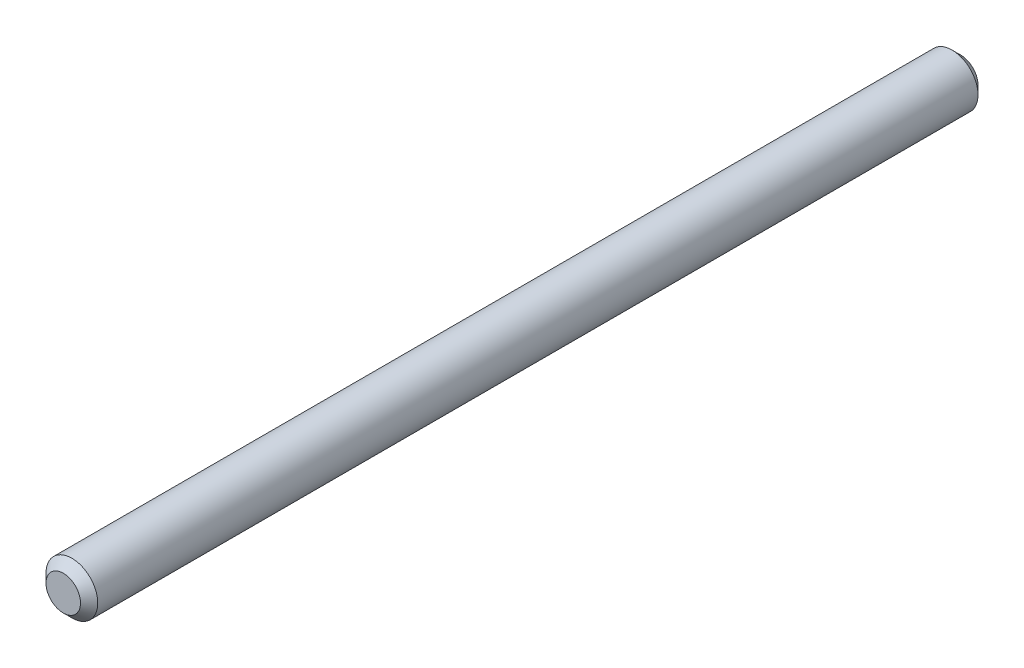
ISO-10303-21;
HEADER;
FILE_DESCRIPTION(('STEP AP214'),'2;1');
FILE_NAME('part.step','',(''),(''),'','','');
FILE_SCHEMA(('AUTOMOTIVE_DESIGN { 1 0 10303 214 1 1 1 1 }'));
ENDSEC;
DATA;
#1=APPLICATION_CONTEXT('core data for automotive mechanical design processes');
#2=APPLICATION_PROTOCOL_DEFINITION('international standard','automotive_design',2000,#1);
#3=PRODUCT_CONTEXT('',#1,'mechanical');
#4=PRODUCT('Part','Part','',(#3));
#5=PRODUCT_RELATED_PRODUCT_CATEGORY('part','',(#4));
#6=PRODUCT_DEFINITION_FORMATION('','',#4);
#7=PRODUCT_DEFINITION_CONTEXT('part definition',#1,'design');
#8=PRODUCT_DEFINITION('design','',#6,#7);
#9=PRODUCT_DEFINITION_SHAPE('','',#8);
#10=(LENGTH_UNIT() NAMED_UNIT(*) SI_UNIT(.MILLI.,.METRE.));
#11=(NAMED_UNIT(*) PLANE_ANGLE_UNIT() SI_UNIT($,.RADIAN.));
#12=(NAMED_UNIT(*) SI_UNIT($,.STERADIAN.) SOLID_ANGLE_UNIT());
#13=UNCERTAINTY_MEASURE_WITH_UNIT(LENGTH_MEASURE(1.E-05),#10,'distance_accuracy_value','');
#14=(GEOMETRIC_REPRESENTATION_CONTEXT(3) GLOBAL_UNCERTAINTY_ASSIGNED_CONTEXT((#13)) GLOBAL_UNIT_ASSIGNED_CONTEXT((#10,
#11,#12)) REPRESENTATION_CONTEXT('',''));
#15=CARTESIAN_POINT('',(0.,0.,0.));
#16=DIRECTION('',(0.,0.,1.));
#17=DIRECTION('',(1.,0.,0.));
#18=AXIS2_PLACEMENT_3D('',#15,#16,#17);
#19=CARTESIAN_POINT('',(0.,0.,52.));
#20=DIRECTION('',(0.,0.,-1.));
#21=DIRECTION('',(-1.,0.,0.));
#22=AXIS2_PLACEMENT_3D('',#19,#20,#21);
#23=CYLINDRICAL_SURFACE('',#22,1.5);
#24=CARTESIAN_POINT('',(0.,0.,51.5));
#25=DIRECTION('',(0.,0.,1.));
#26=DIRECTION('',(1.,0.,0.));
#27=AXIS2_PLACEMENT_3D('',#24,#25,#26);
#28=CIRCLE('',#27,1.5);
#29=CARTESIAN_POINT('',(-1.5,0.,51.5));
#30=VERTEX_POINT('',#29);
#31=EDGE_CURVE('E30',#30,#30,#28,.F.);
#32=CARTESIAN_POINT('',(0.,0.,0.500000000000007));
#33=DIRECTION('',(0.,0.,1.));
#34=DIRECTION('',(1.,0.,0.));
#35=AXIS2_PLACEMENT_3D('',#32,#33,#34);
#36=CIRCLE('',#35,1.5);
#37=CARTESIAN_POINT('',(-1.5,0.,0.5));
#38=VERTEX_POINT('',#37);
#39=EDGE_CURVE('E34',#38,#38,#36,.T.);
#40=CARTESIAN_POINT('',(-1.5,0.,51.5));
#41=CARTESIAN_POINT('',(-1.5,0.,50.96875));
#42=CARTESIAN_POINT('',(-1.5,0.,50.4375));
#43=CARTESIAN_POINT('',(-1.5,0.,49.375));
#44=CARTESIAN_POINT('',(-1.5,0.,48.84375));
#45=CARTESIAN_POINT('',(-1.5,0.,47.78125));
#46=CARTESIAN_POINT('',(-1.5,0.,47.25));
#47=CARTESIAN_POINT('',(-1.5,0.,46.1875));
#48=CARTESIAN_POINT('',(-1.5,0.,45.65625));
#49=CARTESIAN_POINT('',(-1.5,0.,44.59375));
#50=CARTESIAN_POINT('',(-1.5,0.,44.0625));
#51=CARTESIAN_POINT('',(-1.5,0.,43.));
#52=CARTESIAN_POINT('',(-1.5,0.,42.46875));
#53=CARTESIAN_POINT('',(-1.5,0.,41.40625));
#54=CARTESIAN_POINT('',(-1.5,0.,40.875));
#55=CARTESIAN_POINT('',(-1.5,0.,39.8125));
#56=CARTESIAN_POINT('',(-1.5,0.,39.28125));
#57=CARTESIAN_POINT('',(-1.5,0.,38.21875));
#58=CARTESIAN_POINT('',(-1.5,0.,37.6875));
#59=CARTESIAN_POINT('',(-1.5,0.,36.625));
#60=CARTESIAN_POINT('',(-1.5,0.,36.09375));
#61=CARTESIAN_POINT('',(-1.5,0.,35.03125));
#62=CARTESIAN_POINT('',(-1.5,0.,34.5));
#63=CARTESIAN_POINT('',(-1.5,0.,33.4375));
#64=CARTESIAN_POINT('',(-1.5,0.,32.90625));
#65=CARTESIAN_POINT('',(-1.5,0.,31.84375));
#66=CARTESIAN_POINT('',(-1.5,0.,31.3125));
#67=CARTESIAN_POINT('',(-1.5,0.,30.25));
#68=CARTESIAN_POINT('',(-1.5,0.,29.71875));
#69=CARTESIAN_POINT('',(-1.5,0.,28.65625));
#70=CARTESIAN_POINT('',(-1.5,0.,28.125));
#71=CARTESIAN_POINT('',(-1.5,0.,27.0625));
#72=CARTESIAN_POINT('',(-1.5,0.,26.53125));
#73=CARTESIAN_POINT('',(-1.5,0.,25.46875));
#74=CARTESIAN_POINT('',(-1.5,0.,24.9375));
#75=CARTESIAN_POINT('',(-1.5,0.,23.875));
#76=CARTESIAN_POINT('',(-1.5,0.,23.34375));
#77=CARTESIAN_POINT('',(-1.5,0.,22.28125));
#78=CARTESIAN_POINT('',(-1.5,0.,21.75));
#79=CARTESIAN_POINT('',(-1.5,0.,20.6875));
#80=CARTESIAN_POINT('',(-1.5,0.,20.15625));
#81=CARTESIAN_POINT('',(-1.5,0.,19.09375));
#82=CARTESIAN_POINT('',(-1.5,0.,18.5625));
#83=CARTESIAN_POINT('',(-1.5,0.,17.5));
#84=CARTESIAN_POINT('',(-1.5,0.,16.96875));
#85=CARTESIAN_POINT('',(-1.5,0.,15.90625));
#86=CARTESIAN_POINT('',(-1.5,0.,15.375));
#87=CARTESIAN_POINT('',(-1.5,0.,14.3125));
#88=CARTESIAN_POINT('',(-1.5,0.,13.78125));
#89=CARTESIAN_POINT('',(-1.5,0.,12.71875));
#90=CARTESIAN_POINT('',(-1.5,0.,12.1875));
#91=CARTESIAN_POINT('',(-1.5,0.,11.125));
#92=CARTESIAN_POINT('',(-1.5,0.,10.59375));
#93=CARTESIAN_POINT('',(-1.5,0.,9.53125));
#94=CARTESIAN_POINT('',(-1.5,0.,9.));
#95=CARTESIAN_POINT('',(-1.5,0.,7.9375));
#96=CARTESIAN_POINT('',(-1.5,0.,7.40625));
#97=CARTESIAN_POINT('',(-1.5,0.,6.34375));
#98=CARTESIAN_POINT('',(-1.5,0.,5.8125));
#99=CARTESIAN_POINT('',(-1.5,0.,4.75));
#100=CARTESIAN_POINT('',(-1.5,0.,4.21875));
#101=CARTESIAN_POINT('',(-1.5,0.,3.15625));
#102=CARTESIAN_POINT('',(-1.5,0.,2.625));
#103=CARTESIAN_POINT('',(-1.5,0.,1.5625));
#104=CARTESIAN_POINT('',(-1.5,0.,1.03125));
#105=CARTESIAN_POINT('',(-1.5,0.,0.5));
#106=B_SPLINE_CURVE_WITH_KNOTS('',3,(#40,#41,#42,#43,#44,#45,#46,#47,#48,#49,#50,#51,#52,#53,
#54,#55,#56,#57,#58,#59,#60,#61,#62,#63,#64,#65,#66,#67,#68,#69,#70,#71,#72,#73,#74,#75,#76,#77,
#78,#79,#80,#81,#82,#83,#84,#85,#86,#87,#88,#89,#90,#91,#92,#93,#94,#95,#96,#97,#98,#99,#100,
#101,#102,#103,#104,#105),.UNSPECIFIED.,.F.,.F.,(4,2,2,2,2,2,2,2,2,2,2,2,2,2,2,2,2,2,2,2,2,2,2,
2,2,2,2,2,2,2,2,2,4),(0.,1.59375,3.1875,4.78124999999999,6.37499999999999,7.96874999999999,
9.56249999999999,11.15625,12.75,14.34375,15.9375,17.53125,19.125,20.71875,22.3125,23.90625,25.5,
27.09375,28.6875,30.28125,31.875,33.46875,35.0625,36.65625,38.25,39.84375,41.4375,43.03125,
44.625,46.21875,47.8125,49.40625,51.),.UNSPECIFIED.);
#107=EDGE_CURVE('BSEAM24',#30,#38,#106,.T.);
#108=ORIENTED_EDGE('',*,*,#31,.T.);
#109=ORIENTED_EDGE('',*,*,#39,.T.);
#110=ORIENTED_EDGE('',*,*,#107,.T.);
#111=ORIENTED_EDGE('',*,*,#107,.F.);
#112=EDGE_LOOP('',(#108,#110,#109,#111));
#113=FACE_BOUND('',#112,.T.);
#114=ADVANCED_FACE('F24',(#113),#23,.T.);
#115=CARTESIAN_POINT('',(0.,0.,52.));
#116=DIRECTION('',(0.,0.,1.));
#117=DIRECTION('',(1.,0.,0.));
#118=AXIS2_PLACEMENT_3D('',#115,#116,#117);
#119=PLANE('',#118);
#120=CARTESIAN_POINT('',(0.,0.,52.));
#121=DIRECTION('',(0.,0.,1.));
#122=DIRECTION('',(1.,0.,0.));
#123=AXIS2_PLACEMENT_3D('',#120,#121,#122);
#124=CIRCLE('',#123,0.999999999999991);
#125=CARTESIAN_POINT('',(0.999999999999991,0.,52.));
#126=VERTEX_POINT('',#125);
#127=EDGE_CURVE('E38',#126,#126,#124,.T.);
#128=ORIENTED_EDGE('',*,*,#127,.T.);
#129=EDGE_LOOP('',(#128));
#130=FACE_BOUND('',#129,.T.);
#131=ADVANCED_FACE('F44',(#130),#119,.T.);
#132=CARTESIAN_POINT('',(0.,0.,0.));
#133=DIRECTION('',(0.,0.,1.));
#134=DIRECTION('',(1.,0.,0.));
#135=AXIS2_PLACEMENT_3D('',#132,#133,#134);
#136=PLANE('',#135);
#137=CARTESIAN_POINT('',(0.,0.,0.));
#138=DIRECTION('',(0.,0.,1.));
#139=DIRECTION('',(1.,0.,0.));
#140=AXIS2_PLACEMENT_3D('',#137,#138,#139);
#141=CIRCLE('',#140,0.999999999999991);
#142=CARTESIAN_POINT('',(0.999999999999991,0.,0.));
#143=VERTEX_POINT('',#142);
#144=EDGE_CURVE('E10',#143,#143,#141,.F.);
#145=ORIENTED_EDGE('',*,*,#144,.T.);
#146=EDGE_LOOP('',(#145));
#147=FACE_BOUND('',#146,.T.);
#148=ADVANCED_FACE('F49',(#147),#136,.F.);
#149=CARTESIAN_POINT('',(0.,0.,52.));
#150=DIRECTION('',(0.,0.,-1.));
#151=DIRECTION('',(-1.,0.,0.));
#152=AXIS2_PLACEMENT_3D('',#149,#150,#151);
#153=CONICAL_SURFACE('',#152,0.999999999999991,0.785398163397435);
#154=ORIENTED_EDGE('',*,*,#31,.F.);
#155=EDGE_LOOP('',(#154));
#156=FACE_BOUND('',#155,.T.);
#157=ORIENTED_EDGE('',*,*,#127,.F.);
#158=EDGE_LOOP('',(#157));
#159=FACE_BOUND('',#158,.T.);
#160=ADVANCED_FACE('F46',(#156,#159),#153,.T.);
#161=CARTESIAN_POINT('',(0.,0.,0.500000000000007));
#162=DIRECTION('',(0.,0.,1.));
#163=DIRECTION('',(1.,0.,0.));
#164=AXIS2_PLACEMENT_3D('',#161,#162,#163);
#165=CONICAL_SURFACE('',#164,1.5,0.785398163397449);
#166=ORIENTED_EDGE('',*,*,#144,.F.);
#167=EDGE_LOOP('',(#166));
#168=FACE_BOUND('',#167,.T.);
#169=ORIENTED_EDGE('',*,*,#39,.F.);
#170=EDGE_LOOP('',(#169));
#171=FACE_BOUND('',#170,.T.);
#172=ADVANCED_FACE('F48',(#168,#171),#165,.T.);
#173=CLOSED_SHELL('',(#114,#131,#148,#160,#172));
#174=MANIFOLD_SOLID_BREP('B2',#173);
#175=ADVANCED_BREP_SHAPE_REPRESENTATION('',(#18,#174),#14);
#176=SHAPE_DEFINITION_REPRESENTATION(#9,#175);
ENDSEC;
END-ISO-10303-21;
